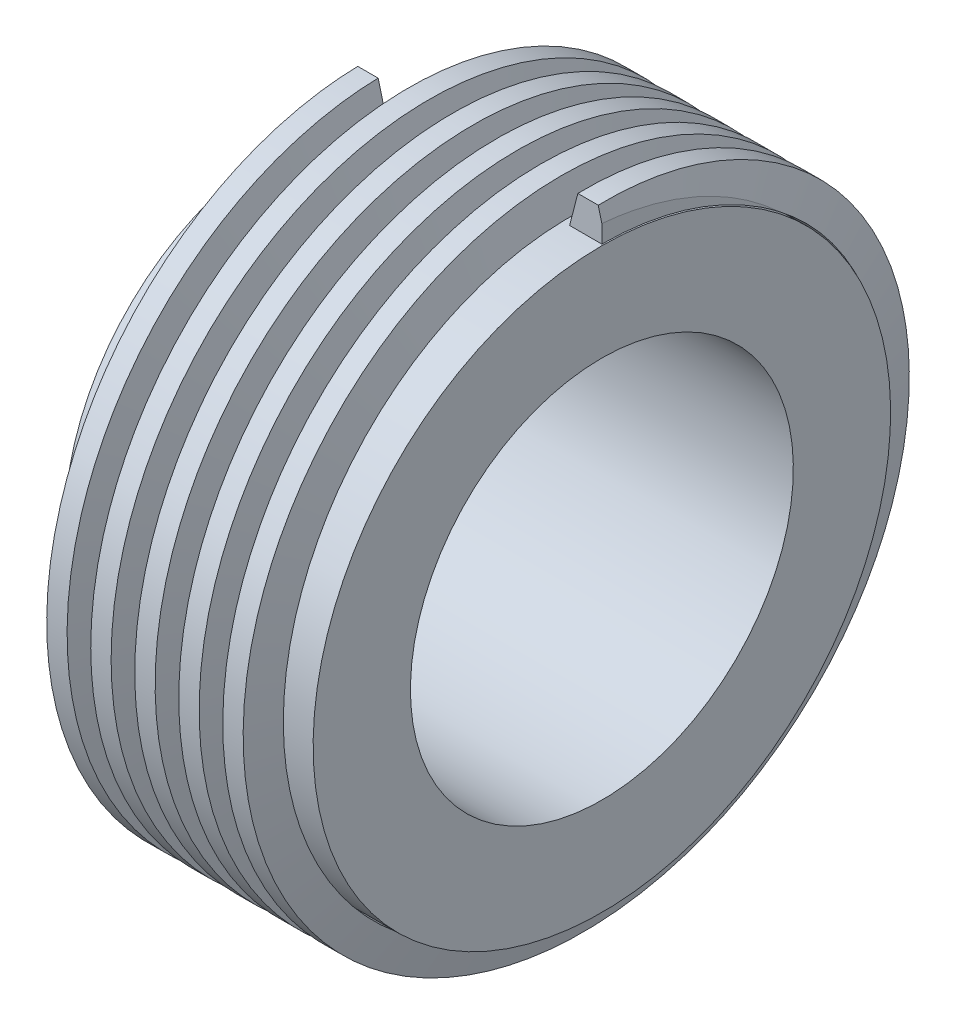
from build123d import *

# Parameters (mm, degrees)
SKETCH7_R          = 18.5039
SKETCH7_R_2        = 16.6624
CUT_EXTRUDE3_DEPTH = 12.7
SWEEP1_PITCH       = 2.54
SWEEP1_HEIGHT      = 12.7
SWEEP1_RADIUS      = 18.5039
SWEEP1_START_ANGLE = -90
SKETCH9_W          = 5.642976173
SKETCH9_H          = 36.542205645
CUT_EXTRUDE4_DEPTH = 25.4
SKETCH11_R         = 11.049
CUT_EXTRUDE7_DEPTH = 33.015112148


with BuildPart() as part:
    # Sketch3 → Revolve1 (revolve)
    with BuildSketch(Plane.XY):
        with BuildLine():
            Line((0, 0), (0, 12.7))
            Line((0, 12.7), (3.048, 12.7))
            ThreePointArc((3.048, 12.7), (4.844051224, 13.443948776), (5.588, 15.24))
            Line((5.588, 15.24), (5.588, 18.5039))
            Line((5.588, 18.5039), (18.288, 18.5039))
            Line((18.288, 18.5039), (18.288, 0))
            Line((18.288, 0), (0, 0))
        make_face()
    revolve(axis=Axis((18.288, 0, 0), (-1, 0, 0)))

    # Sketch7 → Cut-Extrude3 (cut)
    with BuildSketch(Plane(origin=(18.288, 0, 0), x_dir=(0, 0, -1), z_dir=(1, 0, 0))):
        Circle(SKETCH7_R)
        with Locations(Location((0, 0, 0), (0, 0, 90))):
            Circle(SKETCH7_R_2, mode=Mode.SUBTRACT)
    extrude(amount=-CUT_EXTRUDE3_DEPTH, mode=Mode.SUBTRACT)

    # Sketch11 → Cut-Extrude7 (cut, through all)
    with BuildSketch(Plane(origin=(0, 0, 0), x_dir=(0, 0, -1), z_dir=(1, 0, 0))):
        with Locations(Location((0, 0, 0), (0, 0, 90))):
            Circle(SKETCH11_R)
    extrude(amount=CUT_EXTRUDE7_DEPTH, mode=Mode.SUBTRACT)


with BuildPart() as body_2:
    # Sweep1: sweep along a helix
    with BuildLine() as sweep1_path:
        add(Helix(SWEEP1_PITCH, SWEEP1_HEIGHT, SWEEP1_RADIUS, center=(18.288, 0, 0), direction=(-1, 0, 0), mode=Mode.PRIVATE).rotate(Axis((18.288, 0, 0), (-1, 0, 0)), SWEEP1_START_ANGLE))
    # Sketch8 → Sweep1 (sweep)
    with BuildSketch(Plane(origin=(0, 0, 0), x_dir=(1, 0, 0), z_dir=(0, 1, 0))):
        Polygon((13.726791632, 18.581121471), (14.902811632, 18.581121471), (15.379055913, 16.739621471), (13.25054735, 16.739621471), align=None)
    sweep(path=sweep1_path.line, is_frenet=True)

    # Sketch9 → Cut-Extrude4 (cut)
    with BuildSketch(Plane(origin=(0, 0, 0), x_dir=(1, 0, 0), z_dir=(0, 1, 0))):
        with Locations((21.109488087, 1.608702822)):
            Rectangle(SKETCH9_W, SKETCH9_H)
    extrude(amount=CUT_EXTRUDE4_DEPTH, mode=Mode.SUBTRACT)


solid = Compound([part.part, body_2.part])
